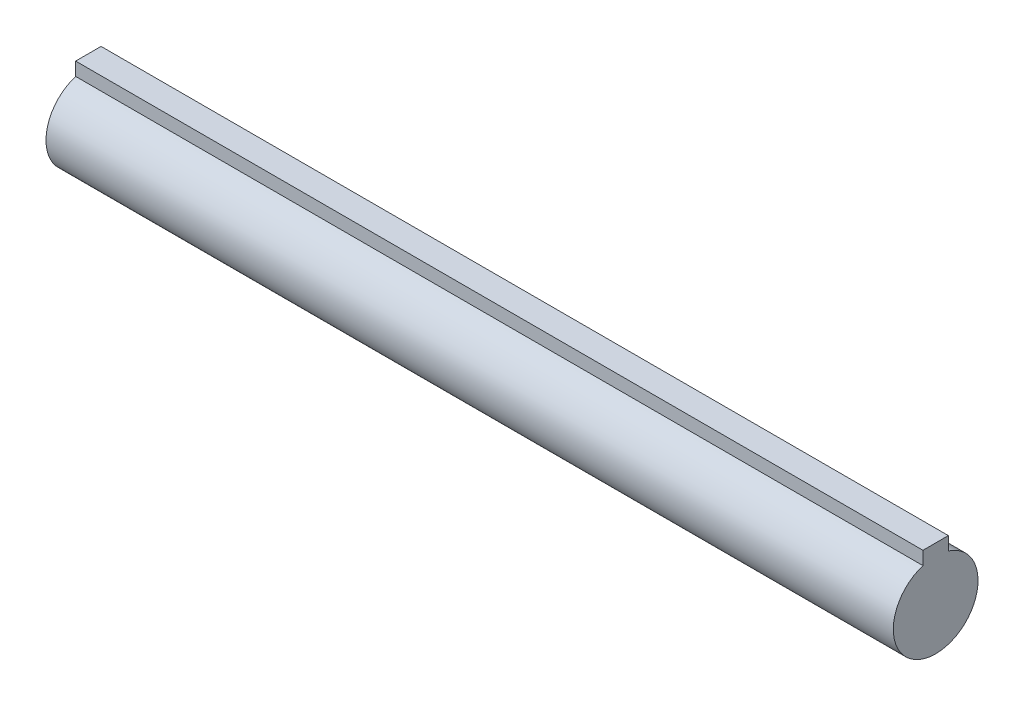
from build123d import *

# Parameters (mm, degrees)
ESQUISSE1_W      = 200
ESQUISSE1_H      = 10
ESQUISSE2_W      = 6
ESQUISSE2_H      = 5.252830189
EXTRUSION1_DEPTH = 200


with BuildPart() as part:
    # Esquisse1 → R_volution1 (revolve)
    with BuildSketch(Plane.XY, mode=Mode.PRIVATE) as r_volution1_sk:
        with Locations((-100, 5)):
            Rectangle(ESQUISSE1_W, ESQUISSE1_H)
    revolve(r_volution1_sk.sketch.rotate(Axis((83.373357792, 0, 0), (-1, 0, 0)), 90), axis=Axis((83.373357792, 0, 0), (-1, 0, 0)))

    # Esquisse2 → Extrusion1 (add)
    with BuildSketch(Plane(origin=(0, 0, 0), x_dir=(0, 0, -1), z_dir=(1, 0, 0))):
        with Locations((0, 10.053584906)):
            Rectangle(ESQUISSE2_W, ESQUISSE2_H)
    extrude(amount=-EXTRUSION1_DEPTH)


solid = part.part
